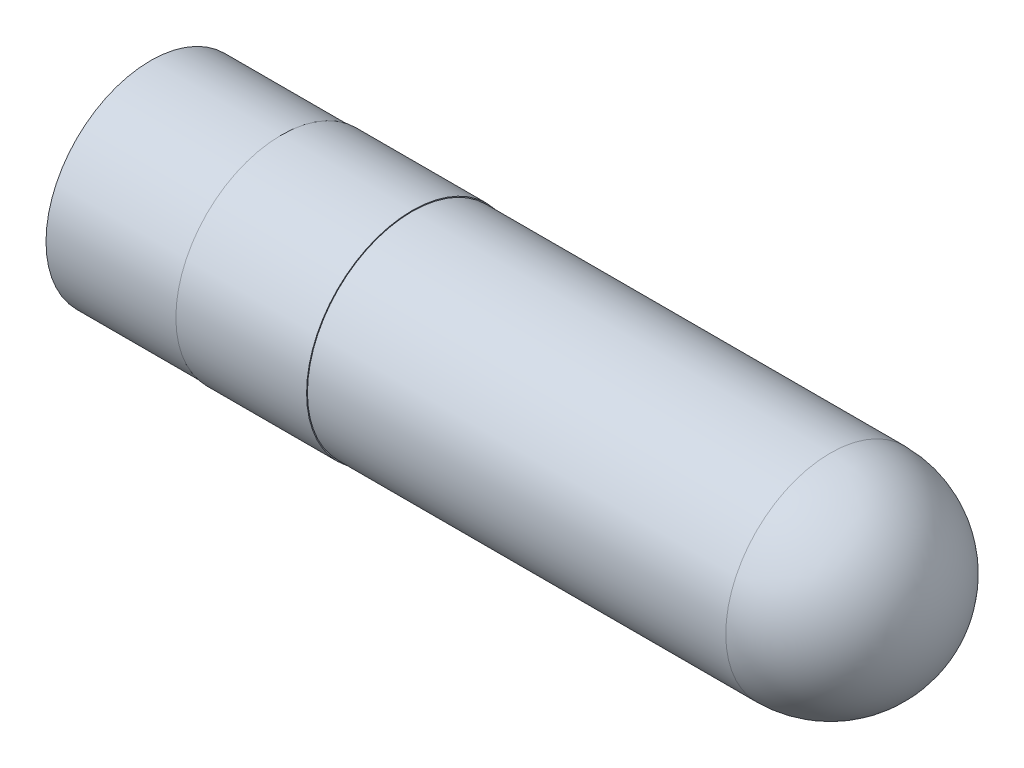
from build123d import *

# Parameters (mm, degrees)
ESQUISSE2_W = 15
ESQUISSE2_H = 0.1


with BuildPart() as part:
    # Esquisse1 → R_volution1 (revolve)
    with BuildSketch(Plane.XY):
        with BuildLine():
            Line((0, 12), (-78, 12))
            Line((-78, 12), (-78, 10.8))
            Line((-78, 10.8), (0, 10.8))
            ThreePointArc((0, 10.8), (7.636753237, 7.636753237), (10.8, 0))
            Line((10.8, 0), (12, 0))
            ThreePointArc((12, 0), (8.485281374, 8.485281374), (0, 12))
        make_face()
    revolve(axis=Axis((-56.520252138, 0, 0), (1, 0, 0)))

    # Esquisse2 → R_volution2 (revolve)
    with BuildSketch(Plane.XY, mode=Mode.PRIVATE) as r_volution2_sk:
        with Locations((-55.5, 12.05)):
            Rectangle(ESQUISSE2_W, ESQUISSE2_H)
    revolve(r_volution2_sk.sketch.rotate(Axis((-88.654414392, 0, 0), (1, 0, 0)), 90), axis=Axis((-88.654414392, 0, 0), (1, 0, 0)))


solid = part.part
